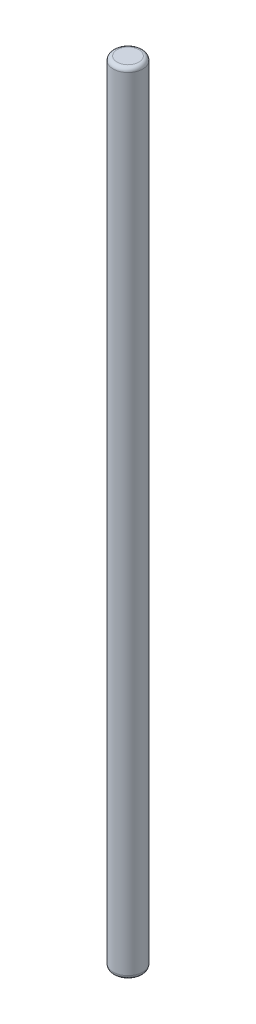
ISO-10303-21;
HEADER;
FILE_DESCRIPTION(('STEP AP214'),'2;1');
FILE_NAME('part.step','',(''),(''),'','','');
FILE_SCHEMA(('AUTOMOTIVE_DESIGN { 1 0 10303 214 1 1 1 1 }'));
ENDSEC;
DATA;
#1=APPLICATION_CONTEXT('core data for automotive mechanical design processes');
#2=APPLICATION_PROTOCOL_DEFINITION('international standard','automotive_design',2000,#1);
#3=PRODUCT_CONTEXT('',#1,'mechanical');
#4=PRODUCT('Part','Part','',(#3));
#5=PRODUCT_RELATED_PRODUCT_CATEGORY('part','',(#4));
#6=PRODUCT_DEFINITION_FORMATION('','',#4);
#7=PRODUCT_DEFINITION_CONTEXT('part definition',#1,'design');
#8=PRODUCT_DEFINITION('design','',#6,#7);
#9=PRODUCT_DEFINITION_SHAPE('','',#8);
#10=(LENGTH_UNIT() NAMED_UNIT(*) SI_UNIT(.MILLI.,.METRE.));
#11=(NAMED_UNIT(*) PLANE_ANGLE_UNIT() SI_UNIT($,.RADIAN.));
#12=(NAMED_UNIT(*) SI_UNIT($,.STERADIAN.) SOLID_ANGLE_UNIT());
#13=UNCERTAINTY_MEASURE_WITH_UNIT(LENGTH_MEASURE(1.E-05),#10,'distance_accuracy_value','');
#14=(GEOMETRIC_REPRESENTATION_CONTEXT(3) GLOBAL_UNCERTAINTY_ASSIGNED_CONTEXT((#13)) GLOBAL_UNIT_ASSIGNED_CONTEXT((#10,
#11,#12)) REPRESENTATION_CONTEXT('',''));
#15=CARTESIAN_POINT('',(0.,0.,0.));
#16=DIRECTION('',(0.,0.,1.));
#17=DIRECTION('',(1.,0.,0.));
#18=AXIS2_PLACEMENT_3D('',#15,#16,#17);
#19=CARTESIAN_POINT('',(0.,-20.,0.));
#20=DIRECTION('',(0.,1.,0.));
#21=DIRECTION('',(0.,0.,1.));
#22=AXIS2_PLACEMENT_3D('',#19,#20,#21);
#23=CYLINDRICAL_SURFACE('',#22,0.75);
#24=CARTESIAN_POINT('',(0.,-19.8,0.));
#25=DIRECTION('',(0.,1.,0.));
#26=DIRECTION('',(0.,0.,1.));
#27=AXIS2_PLACEMENT_3D('',#24,#25,#26);
#28=CIRCLE('',#27,0.75);
#29=CARTESIAN_POINT('',(0.,-19.8,0.75));
#30=VERTEX_POINT('',#29);
#31=EDGE_CURVE('E48',#30,#30,#28,.T.);
#32=ORIENTED_EDGE('',*,*,#31,.T.);
#33=EDGE_LOOP('',(#32));
#34=FACE_BOUND('',#33,.T.);
#35=CARTESIAN_POINT('',(0.,19.8,0.));
#36=DIRECTION('',(0.,1.,0.));
#37=DIRECTION('',(0.,0.,1.));
#38=AXIS2_PLACEMENT_3D('',#35,#36,#37);
#39=CIRCLE('',#38,0.75);
#40=CARTESIAN_POINT('',(0.,19.8,0.75));
#41=VERTEX_POINT('',#40);
#42=EDGE_CURVE('E52',#41,#41,#39,.F.);
#43=ORIENTED_EDGE('',*,*,#42,.T.);
#44=EDGE_LOOP('',(#43));
#45=FACE_BOUND('',#44,.T.);
#46=ADVANCED_FACE('F37',(#34,#45),#23,.T.);
#47=CARTESIAN_POINT('',(0.,-20.,0.));
#48=DIRECTION('',(0.,1.,0.));
#49=DIRECTION('',(0.,0.,1.));
#50=AXIS2_PLACEMENT_3D('',#47,#48,#49);
#51=PLANE('',#50);
#52=CARTESIAN_POINT('',(0.,-20.,0.));
#53=DIRECTION('',(0.,1.,0.));
#54=DIRECTION('',(0.,0.,1.));
#55=AXIS2_PLACEMENT_3D('',#52,#53,#54);
#56=CIRCLE('',#55,0.55);
#57=CARTESIAN_POINT('',(0.,-20.,0.55));
#58=VERTEX_POINT('',#57);
#59=EDGE_CURVE('E44',#58,#58,#56,.F.);
#60=ORIENTED_EDGE('',*,*,#59,.T.);
#61=EDGE_LOOP('',(#60));
#62=FACE_BOUND('',#61,.T.);
#63=ADVANCED_FACE('F68',(#62),#51,.F.);
#64=CARTESIAN_POINT('',(0.,20.,0.));
#65=DIRECTION('',(0.,1.,0.));
#66=DIRECTION('',(0.,0.,1.));
#67=AXIS2_PLACEMENT_3D('',#64,#65,#66);
#68=PLANE('',#67);
#69=CARTESIAN_POINT('',(0.,20.,0.));
#70=DIRECTION('',(0.,1.,0.));
#71=DIRECTION('',(0.,0.,1.));
#72=AXIS2_PLACEMENT_3D('',#69,#70,#71);
#73=CIRCLE('',#72,0.55);
#74=CARTESIAN_POINT('',(0.,20.,0.55));
#75=VERTEX_POINT('',#74);
#76=EDGE_CURVE('E10',#75,#75,#73,.T.);
#77=ORIENTED_EDGE('',*,*,#76,.T.);
#78=EDGE_LOOP('',(#77));
#79=FACE_BOUND('',#78,.T.);
#80=ADVANCED_FACE('F65',(#79),#68,.T.);
#81=CARTESIAN_POINT('',(0.,-19.8,0.));
#82=DIRECTION('',(0.,1.,0.));
#83=DIRECTION('',(0.,0.,1.));
#84=AXIS2_PLACEMENT_3D('',#81,#82,#83);
#85=TOROIDAL_SURFACE('',#84,0.55,0.2);
#86=ORIENTED_EDGE('',*,*,#59,.F.);
#87=EDGE_LOOP('',(#86));
#88=FACE_BOUND('',#87,.T.);
#89=ORIENTED_EDGE('',*,*,#31,.F.);
#90=EDGE_LOOP('',(#89));
#91=FACE_BOUND('',#90,.T.);
#92=ADVANCED_FACE('F61',(#88,#91),#85,.T.);
#93=CARTESIAN_POINT('',(0.,19.8,0.));
#94=DIRECTION('',(0.,1.,0.));
#95=DIRECTION('',(0.,0.,1.));
#96=AXIS2_PLACEMENT_3D('',#93,#94,#95);
#97=TOROIDAL_SURFACE('',#96,0.55,0.2);
#98=ORIENTED_EDGE('',*,*,#42,.F.);
#99=EDGE_LOOP('',(#98));
#100=FACE_BOUND('',#99,.T.);
#101=ORIENTED_EDGE('',*,*,#76,.F.);
#102=EDGE_LOOP('',(#101));
#103=FACE_BOUND('',#102,.T.);
#104=ADVANCED_FACE('F39',(#100,#103),#97,.T.);
#105=CLOSED_SHELL('',(#46,#63,#80,#92,#104));
#106=MANIFOLD_SOLID_BREP('B2',#105);
#107=ADVANCED_BREP_SHAPE_REPRESENTATION('',(#18,#106),#14);
#108=SHAPE_DEFINITION_REPRESENTATION(#9,#107);
ENDSEC;
END-ISO-10303-21;
